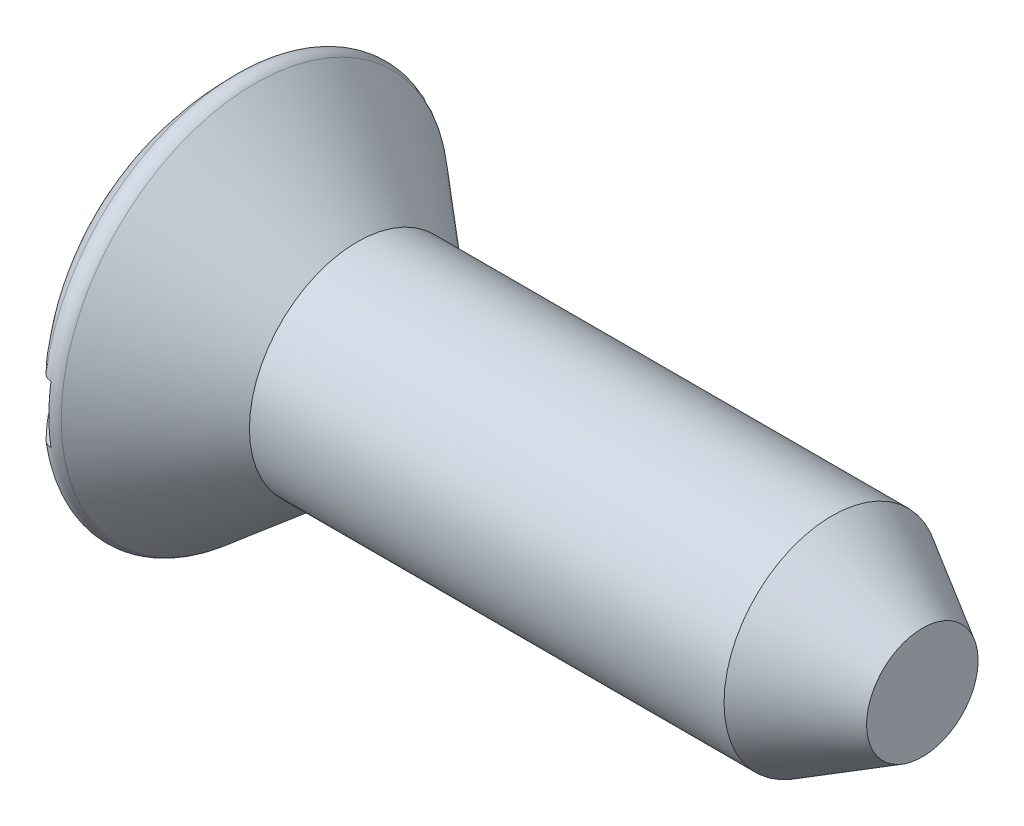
from build123d import *

# Parameters (mm, degrees)
SLOT_CUT_EXTRUDE1_DEPTH      = 6.164268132
SLOT_CUT_EXTRUDE1_DEPTH_BACK = 6.164268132
SKETCH2_W                    = 0.635
SKETCH2_H                    = 0.4064


with BuildPart() as part:
    # Sketch1 → base-Revolve (revolve)
    with BuildSketch(Plane.XY, mode=Mode.PRIVATE) as base_revolve_sk:
        with BuildLine():
            Line((0.064424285, 1.368341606), (0.787034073, 0.762))
            Line((0.787034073, 0.762), (4.7752, 0.762))
            Line((4.7752, 0.762), (4.7752, 0))
            Line((4.7752, 0), (0, 0))
            Line((0, 0), (-0.635365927, 0))
            ThreePointArc((-0.635365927, 0), (-0.486452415, 0.739344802), (-0.062933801, 1.363394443))
            ThreePointArc((-0.062933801, 1.363394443), (-0.000209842, 1.390455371), (0.064424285, 1.368341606))
        make_face()
    revolve(base_revolve_sk.sketch.rotate(Axis((0, 0, 0), (1, 0, 0)), 90), axis=Axis((0, 0, 0), (1, 0, 0)))

    # Sketch2 → slot_Cut-Extrude1 (cut, two sides: drawn at the far end of the back side and taken through both)
    with BuildSketch(Plane.XY.offset(-SLOT_CUT_EXTRUDE1_DEPTH_BACK)):
        with Locations((-0.317865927, 0)):
            Rectangle(SKETCH2_W, SKETCH2_H)
    extrude(amount=SLOT_CUT_EXTRUDE1_DEPTH + SLOT_CUT_EXTRUDE1_DEPTH_BACK, mode=Mode.SUBTRACT)

    # Sketch8 → point_Cut-Revolve1 (revolve, cut)
    with BuildSketch(Plane.XY, mode=Mode.PRIVATE) as point_cut_revolve1_sk:
        Polygon((4.7752, 0), (5.2832, 0), (5.2832, 1.27), (4.137285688, 1.27), (4.137285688, 0.762), (4.7752, 0.3937), align=None)
    revolve(point_cut_revolve1_sk.sketch.rotate(Axis((0, 0, 0), (1, 0, 0)), 90), axis=Axis((0, 0, 0), (1, 0, 0)), mode=Mode.SUBTRACT)


solid = part.part
